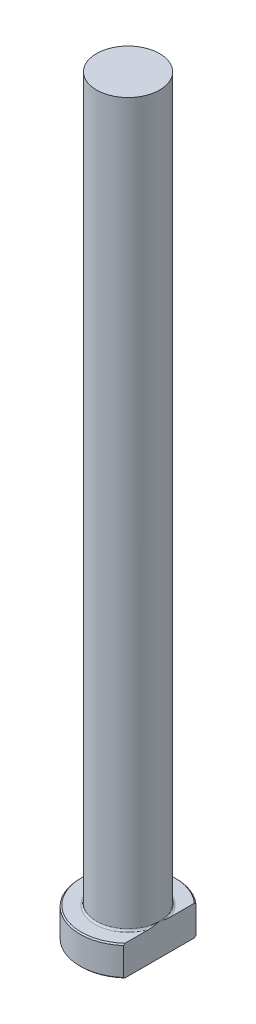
ISO-10303-21;
HEADER;
FILE_DESCRIPTION(('STEP AP214'),'2;1');
FILE_NAME('part.step','',(''),(''),'','','');
FILE_SCHEMA(('AUTOMOTIVE_DESIGN { 1 0 10303 214 1 1 1 1 }'));
ENDSEC;
DATA;
#1=APPLICATION_CONTEXT('core data for automotive mechanical design processes');
#2=APPLICATION_PROTOCOL_DEFINITION('international standard','automotive_design',2000,#1);
#3=PRODUCT_CONTEXT('',#1,'mechanical');
#4=PRODUCT('Part','Part','',(#3));
#5=PRODUCT_RELATED_PRODUCT_CATEGORY('part','',(#4));
#6=PRODUCT_DEFINITION_FORMATION('','',#4);
#7=PRODUCT_DEFINITION_CONTEXT('part definition',#1,'design');
#8=PRODUCT_DEFINITION('design','',#6,#7);
#9=PRODUCT_DEFINITION_SHAPE('','',#8);
#10=(LENGTH_UNIT() NAMED_UNIT(*) SI_UNIT(.MILLI.,.METRE.));
#11=(NAMED_UNIT(*) PLANE_ANGLE_UNIT() SI_UNIT($,.RADIAN.));
#12=(NAMED_UNIT(*) SI_UNIT($,.STERADIAN.) SOLID_ANGLE_UNIT());
#13=UNCERTAINTY_MEASURE_WITH_UNIT(LENGTH_MEASURE(1.E-05),#10,'distance_accuracy_value','');
#14=(GEOMETRIC_REPRESENTATION_CONTEXT(3) GLOBAL_UNCERTAINTY_ASSIGNED_CONTEXT((#13)) GLOBAL_UNIT_ASSIGNED_CONTEXT((#10,
#11,#12)) REPRESENTATION_CONTEXT('',''));
#15=CARTESIAN_POINT('',(0.,0.,0.));
#16=DIRECTION('',(0.,0.,1.));
#17=DIRECTION('',(1.,0.,0.));
#18=AXIS2_PLACEMENT_3D('',#15,#16,#17);
#19=CARTESIAN_POINT('',(0.,0.,0.));
#20=DIRECTION('',(0.,-1.,0.));
#21=DIRECTION('',(0.,0.,-1.));
#22=AXIS2_PLACEMENT_3D('',#19,#20,#21);
#23=PLANE('',#22);
#24=CARTESIAN_POINT('',(0.,0.,0.));
#25=DIRECTION('',(0.,-1.,0.));
#26=DIRECTION('',(0.,0.,-1.));
#27=AXIS2_PLACEMENT_3D('',#24,#25,#26);
#28=CIRCLE('',#27,7.80000000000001);
#29=CARTESIAN_POINT('',(5.24999999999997,0.,5.76866535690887));
#30=VERTEX_POINT('',#29);
#31=CARTESIAN_POINT('',(5.24999999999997,0.,-5.76866535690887));
#32=VERTEX_POINT('',#31);
#33=EDGE_CURVE('E98',#30,#32,#28,.T.);
#34=ORIENTED_EDGE('',*,*,#33,.T.);
#35=DIRECTION('',(0.,0.,1.));
#36=VECTOR('',#35,1.);
#37=CARTESIAN_POINT('',(5.24999999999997,0.,-6.0363482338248));
#38=LINE('',#37,#36);
#39=EDGE_CURVE('E83',#32,#30,#38,.T.);
#40=ORIENTED_EDGE('',*,*,#39,.T.);
#41=EDGE_LOOP('',(#34,#40));
#42=FACE_BOUND('',#41,.T.);
#43=ADVANCED_FACE('F32',(#42),#23,.T.);
#44=CARTESIAN_POINT('',(0.,259.958771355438,0.));
#45=DIRECTION('',(0.,1.,0.));
#46=DIRECTION('',(0.,0.,1.));
#47=AXIS2_PLACEMENT_3D('',#44,#45,#46);
#48=CYLINDRICAL_SURFACE('',#47,7.99999999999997);
#49=CARTESIAN_POINT('',(0.,4.79999999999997,0.));
#50=DIRECTION('',(0.,1.,0.));
#51=DIRECTION('',(0.,0.,1.));
#52=AXIS2_PLACEMENT_3D('',#49,#50,#51);
#53=CIRCLE('',#52,7.99999999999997);
#54=CARTESIAN_POINT('',(5.24999999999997,4.79999999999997,6.0363482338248));
#55=VERTEX_POINT('',#54);
#56=CARTESIAN_POINT('',(5.24999999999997,4.79999999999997,-6.0363482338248));
#57=VERTEX_POINT('',#56);
#58=EDGE_CURVE('E104',#55,#57,#53,.F.);
#59=ORIENTED_EDGE('',*,*,#58,.T.);
#60=DIRECTION('',(0.,-1.,0.));
#61=VECTOR('',#60,1.);
#62=CARTESIAN_POINT('',(5.24999999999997,125.,-6.0363482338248));
#63=LINE('',#62,#61);
#64=CARTESIAN_POINT('',(5.24999999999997,0.199999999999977,-6.0363482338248));
#65=VERTEX_POINT('',#64);
#66=EDGE_CURVE('E183',#57,#65,#63,.T.);
#67=ORIENTED_EDGE('',*,*,#66,.T.);
#68=CARTESIAN_POINT('',(0.,0.199999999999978,0.));
#69=DIRECTION('',(0.,-1.,0.));
#70=DIRECTION('',(0.,0.,-1.));
#71=AXIS2_PLACEMENT_3D('',#68,#69,#70);
#72=CIRCLE('',#71,7.99999999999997);
#73=CARTESIAN_POINT('',(5.24999999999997,0.199999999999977,6.0363482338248));
#74=VERTEX_POINT('',#73);
#75=EDGE_CURVE('E100',#65,#74,#72,.F.);
#76=ORIENTED_EDGE('',*,*,#75,.T.);
#77=DIRECTION('',(0.,-1.,0.));
#78=VECTOR('',#77,1.);
#79=CARTESIAN_POINT('',(5.24999999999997,125.,6.0363482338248));
#80=LINE('',#79,#78);
#81=EDGE_CURVE('E93',#55,#74,#80,.T.);
#82=ORIENTED_EDGE('',*,*,#81,.F.);
#83=EDGE_LOOP('',(#59,#67,#76,#82));
#84=FACE_BOUND('',#83,.T.);
#85=ADVANCED_FACE('F158',(#84),#48,.T.);
#86=CARTESIAN_POINT('',(-7.99999999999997,5.,0.));
#87=DIRECTION('',(0.,1.,0.));
#88=DIRECTION('',(0.,0.,1.));
#89=AXIS2_PLACEMENT_3D('',#86,#87,#88);
#90=PLANE('',#89);
#91=CARTESIAN_POINT('',(0.,5.,0.));
#92=DIRECTION('',(0.,1.,0.));
#93=DIRECTION('',(0.,0.,1.));
#94=AXIS2_PLACEMENT_3D('',#91,#92,#93);
#95=CIRCLE('',#94,7.79999999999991);
#96=CARTESIAN_POINT('',(5.24999999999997,5.,-5.76866535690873));
#97=VERTEX_POINT('',#96);
#98=CARTESIAN_POINT('',(5.24999999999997,5.,5.76866535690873));
#99=VERTEX_POINT('',#98);
#100=EDGE_CURVE('E178',#97,#99,#95,.T.);
#101=ORIENTED_EDGE('',*,*,#100,.T.);
#102=DIRECTION('',(0.,0.,-1.));
#103=VECTOR('',#102,1.);
#104=CARTESIAN_POINT('',(5.24999999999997,5.,0.));
#105=LINE('',#104,#103);
#106=CARTESIAN_POINT('',(5.24999999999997,4.99999999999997,1.79999999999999));
#107=VERTEX_POINT('',#106);
#108=EDGE_CURVE('E57',#99,#107,#105,.T.);
#109=ORIENTED_EDGE('',*,*,#108,.T.);
#110=CARTESIAN_POINT('',(0.,5.,0.));
#111=DIRECTION('',(0.,1.,0.));
#112=DIRECTION('',(0.,0.,1.));
#113=AXIS2_PLACEMENT_3D('',#110,#111,#112);
#114=CIRCLE('',#113,5.54999999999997);
#115=CARTESIAN_POINT('',(5.24999999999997,4.99999999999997,-1.79999999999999));
#116=VERTEX_POINT('',#115);
#117=EDGE_CURVE('E107',#107,#116,#114,.F.);
#118=ORIENTED_EDGE('',*,*,#117,.T.);
#119=EDGE_CURVE('E136',#116,#97,#105,.T.);
#120=ORIENTED_EDGE('',*,*,#119,.T.);
#121=EDGE_LOOP('',(#101,#109,#118,#120));
#122=FACE_BOUND('',#121,.T.);
#123=ADVANCED_FACE('F147',(#122),#90,.T.);
#124=CARTESIAN_POINT('',(0.,5.,0.));
#125=DIRECTION('',(0.,-1.,0.));
#126=DIRECTION('',(0.,0.,-1.));
#127=AXIS2_PLACEMENT_3D('',#124,#125,#126);
#128=CONICAL_SURFACE('',#127,7.7999999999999,0.785398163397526);
#129=ORIENTED_EDGE('',*,*,#58,.F.);
#130=CARTESIAN_POINT('',(5.24999999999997,-1.48116632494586,13.2811600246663));
#131=CARTESIAN_POINT('',(5.24999999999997,-1.29357250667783,13.0794377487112));
#132=CARTESIAN_POINT('',(5.24999999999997,-1.1062845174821,12.8774311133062));
#133=CARTESIAN_POINT('',(5.24999999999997,-0.73241592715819,12.4727618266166));
#134=CARTESIAN_POINT('',(5.24999999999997,-0.545835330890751,12.270099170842));
#135=CARTESIAN_POINT('',(5.24999999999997,0.0127787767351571,11.6609122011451));
#136=CARTESIAN_POINT('',(5.24999999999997,0.383603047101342,11.2532764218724));
#137=CARTESIAN_POINT('',(5.24999999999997,1.1232534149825,10.4315008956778));
#138=CARTESIAN_POINT('',(5.24999999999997,1.49205195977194,10.0173363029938));
#139=CARTESIAN_POINT('',(5.24999999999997,2.22349880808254,9.18368237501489));
#140=CARTESIAN_POINT('',(5.24999999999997,2.58614786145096,8.76419369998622));
#141=CARTESIAN_POINT('',(5.24999999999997,3.23008746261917,8.00331710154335));
#142=CARTESIAN_POINT('',(5.24999999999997,3.51299211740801,7.66330157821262));
#143=CARTESIAN_POINT('',(5.24999999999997,3.93141579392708,7.14837202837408));
#144=CARTESIAN_POINT('',(5.24999999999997,4.06992138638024,6.97588542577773));
#145=CARTESIAN_POINT('',(5.24999999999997,4.3445270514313,6.62901010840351));
#146=CARTESIAN_POINT('',(5.24999999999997,4.48062717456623,6.45462143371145));
#147=CARTESIAN_POINT('',(5.24999999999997,4.74973822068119,6.10383934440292));
#148=CARTESIAN_POINT('',(5.24999999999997,4.88275300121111,5.92744889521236));
#149=CARTESIAN_POINT('',(5.24999999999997,5.14521399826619,5.57203856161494));
#150=CARTESIAN_POINT('',(5.24999999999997,5.27466038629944,5.39301880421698));
#151=CARTESIAN_POINT('',(5.24999999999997,5.52907482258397,5.03192492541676));
#152=CARTESIAN_POINT('',(5.24999999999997,5.65404469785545,4.84985209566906));
#153=CARTESIAN_POINT('',(5.24999999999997,5.89840426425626,4.48201214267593));
#154=CARTESIAN_POINT('',(5.24999999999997,6.01779462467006,4.2962454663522));
#155=CARTESIAN_POINT('',(5.24999999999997,6.24171029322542,3.93290441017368));
#156=CARTESIAN_POINT('',(5.24999999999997,6.346695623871,3.75561494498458));
#157=CARTESIAN_POINT('',(5.24999999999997,6.54883017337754,3.39656407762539));
#158=CARTESIAN_POINT('',(5.24999999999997,6.64597853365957,3.21480218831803));
#159=CARTESIAN_POINT('',(5.24999999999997,6.83020392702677,2.84629933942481));
#160=CARTESIAN_POINT('',(5.24999999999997,6.91728535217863,2.6595605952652));
#161=CARTESIAN_POINT('',(5.24999999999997,7.07861709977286,2.28058919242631));
#162=CARTESIAN_POINT('',(5.24999999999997,7.15287080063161,2.08835799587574));
#163=CARTESIAN_POINT('',(5.24999999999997,7.27107095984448,1.73993363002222));
#164=CARTESIAN_POINT('',(5.24999999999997,7.31810380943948,1.58479376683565));
#165=CARTESIAN_POINT('',(5.24999999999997,7.40035184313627,1.27142880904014));
#166=CARTESIAN_POINT('',(5.24999999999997,7.43557139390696,1.11320487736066));
#167=CARTESIAN_POINT('',(5.24999999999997,7.49247262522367,0.794842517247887));
#168=CARTESIAN_POINT('',(5.24999999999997,7.51419839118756,0.63471208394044));
#169=CARTESIAN_POINT('',(5.24999999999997,7.54310705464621,0.313132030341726));
#170=CARTESIAN_POINT('',(5.24999999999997,7.55029089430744,0.151682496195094));
#171=CARTESIAN_POINT('',(5.24999999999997,7.54968998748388,-0.171726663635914));
#172=CARTESIAN_POINT('',(5.24999999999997,7.54185529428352,-0.333686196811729));
#173=CARTESIAN_POINT('',(5.24999999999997,7.51158499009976,-0.656223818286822));
#174=CARTESIAN_POINT('',(5.24999999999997,7.48914825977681,-0.816801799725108));
#175=CARTESIAN_POINT('',(5.24999999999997,7.43080718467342,-1.1359788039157));
#176=CARTESIAN_POINT('',(5.24999999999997,7.39486058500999,-1.29456998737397));
#177=CARTESIAN_POINT('',(5.24999999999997,7.3111836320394,-1.608578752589));
#178=CARTESIAN_POINT('',(5.24999999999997,7.26345259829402,-1.76399615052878));
#179=CARTESIAN_POINT('',(5.24999999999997,7.1531515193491,-2.0854871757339));
#180=CARTESIAN_POINT('',(5.24999999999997,7.08962117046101,-2.25122835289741));
#181=CARTESIAN_POINT('',(5.24999999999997,6.95279918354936,-2.57864196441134));
#182=CARTESIAN_POINT('',(5.24999999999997,6.87950469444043,-2.74031319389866));
#183=CARTESIAN_POINT('',(5.24999999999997,6.72489088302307,-3.06007692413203));
#184=CARTESIAN_POINT('',(5.24999999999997,6.64355831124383,-3.2181629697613));
#185=CARTESIAN_POINT('',(5.24999999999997,6.47449809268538,-3.53083072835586));
#186=CARTESIAN_POINT('',(5.24999999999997,6.38677122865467,-3.68541286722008));
#187=CARTESIAN_POINT('',(5.24999999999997,6.20495786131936,-3.99346169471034));
#188=CARTESIAN_POINT('',(5.24999999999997,6.11080410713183,-4.1468885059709));
#189=CARTESIAN_POINT('',(5.24999999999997,5.91814750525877,-4.45098066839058));
#190=CARTESIAN_POINT('',(5.24999999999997,5.81964456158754,-4.60164595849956));
#191=CARTESIAN_POINT('',(5.24999999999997,5.61916095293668,-4.9004290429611));
#192=CARTESIAN_POINT('',(5.24999999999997,5.51718369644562,-5.04854913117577));
#193=CARTESIAN_POINT('',(5.24999999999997,5.31027155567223,-5.34270095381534));
#194=CARTESIAN_POINT('',(5.24999999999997,5.2053367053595,-5.48873271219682));
#195=CARTESIAN_POINT('',(5.24999999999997,4.97106981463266,-5.80895105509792));
#196=CARTESIAN_POINT('',(5.24999999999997,4.84117419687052,-5.98272485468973));
#197=CARTESIAN_POINT('',(5.24999999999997,4.57844088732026,-6.32803694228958));
#198=CARTESIAN_POINT('',(5.24999999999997,4.44560309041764,-6.49957515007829));
#199=CARTESIAN_POINT('',(5.24999999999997,4.04344241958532,-7.01138747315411));
#200=CARTESIAN_POINT('',(5.24999999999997,3.77050218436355,-7.34881891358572));
#201=CARTESIAN_POINT('',(5.24999999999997,3.21761339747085,-8.01842681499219));
#202=CARTESIAN_POINT('',(5.24999999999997,2.93765803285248,-8.35059761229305));
#203=CARTESIAN_POINT('',(5.24999999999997,2.37280482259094,-9.01071908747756));
#204=CARTESIAN_POINT('',(5.24999999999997,2.08790682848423,-9.33866963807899));
#205=CARTESIAN_POINT('',(5.24999999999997,1.53221513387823,-9.97104652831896));
#206=CARTESIAN_POINT('',(5.24999999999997,1.26164416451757,-10.2756690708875));
#207=CARTESIAN_POINT('',(5.24999999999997,0.717945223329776,-10.8826342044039));
#208=CARTESIAN_POINT('',(5.24999999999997,0.444817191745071,-11.1849767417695));
#209=CARTESIAN_POINT('',(5.24999999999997,-0.102863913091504,-11.7871569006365));
#210=CARTESIAN_POINT('',(5.24999999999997,-0.3774125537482,-12.0869985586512));
#211=CARTESIAN_POINT('',(5.24999999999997,-0.92814850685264,-12.6851474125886));
#212=CARTESIAN_POINT('',(5.24999999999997,-1.20433574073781,-12.9834546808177));
#213=CARTESIAN_POINT('',(5.24999999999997,-1.48116632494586,-13.2811600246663));
#214=B_SPLINE_CURVE_WITH_KNOTS('',3,(#130,#131,#132,#133,#134,#135,#136,#137,#138,#139,#140,
#141,#142,#143,#144,#145,#146,#147,#148,#149,#150,#151,#152,#153,#154,#155,#156,#157,#158,#159,
#160,#161,#162,#163,#164,#165,#166,#167,#168,#169,#170,#171,#172,#173,#174,#175,#176,#177,#178,
#179,#180,#181,#182,#183,#184,#185,#186,#187,#188,#189,#190,#191,#192,#193,#194,#195,#196,#197,
#198,#199,#200,#201,#202,#203,#204,#205,#206,#207,#208,#209,#210,#211,#212,#213),.UNSPECIFIED.,
.F.,.F.,(4,2,2,2,2,2,2,2,2,2,2,2,2,2,2,2,2,2,2,2,2,2,2,2,2,2,2,2,2,2,2,2,2,2,2,2,2,2,2,2,2,4),
(0.,0.826407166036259,1.65282000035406,3.30600459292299,4.96966514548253,6.63312135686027,
7.95997894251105,8.62360280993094,9.28721271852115,9.9499425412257,10.6126404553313,
11.2750647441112,11.9374093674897,12.5553811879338,13.1734206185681,13.791189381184,
14.4087951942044,14.8947423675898,15.3805097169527,15.8646815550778,16.3488220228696,
16.8345753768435,17.3203659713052,17.8076887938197,18.295039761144,18.8271554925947,
19.359426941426,19.8925908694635,20.4256896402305,20.9656407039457,21.5056036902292,
22.0450513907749,22.5844928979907,23.2353229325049,23.8861762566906,25.1880335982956,
26.4912084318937,27.794422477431,29.0167115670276,30.2390292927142,31.4586693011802,
32.678251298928),.UNSPECIFIED.);
#215=EDGE_CURVE('E135',#55,#99,#214,.T.);
#216=ORIENTED_EDGE('',*,*,#215,.T.);
#217=ORIENTED_EDGE('',*,*,#100,.F.);
#218=EDGE_CURVE('E127',#97,#57,#214,.T.);
#219=ORIENTED_EDGE('',*,*,#218,.T.);
#220=EDGE_LOOP('',(#129,#216,#217,#219));
#221=FACE_BOUND('',#220,.T.);
#222=ADVANCED_FACE('F143',(#221),#128,.T.);
#223=CARTESIAN_POINT('',(0.,0.199999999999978,0.));
#224=DIRECTION('',(0.,1.,0.));
#225=DIRECTION('',(0.,0.,1.));
#226=AXIS2_PLACEMENT_3D('',#223,#224,#225);
#227=CONICAL_SURFACE('',#226,7.99999999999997,0.785398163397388);
#228=ORIENTED_EDGE('',*,*,#75,.F.);
#229=CARTESIAN_POINT('',(5.24999999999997,6.48116632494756,-13.2811600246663));
#230=CARTESIAN_POINT('',(5.24999999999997,6.2935725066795,-13.0794377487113));
#231=CARTESIAN_POINT('',(5.24999999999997,6.10628451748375,-12.8774311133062));
#232=CARTESIAN_POINT('',(5.24999999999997,5.73241592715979,-12.4727618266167));
#233=CARTESIAN_POINT('',(5.24999999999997,5.54583533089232,-12.2700991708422));
#234=CARTESIAN_POINT('',(5.24999999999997,4.98722122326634,-11.6609122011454));
#235=CARTESIAN_POINT('',(5.24999999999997,4.61639695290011,-11.2532764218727));
#236=CARTESIAN_POINT('',(5.24999999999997,3.87674658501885,-10.4315008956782));
#237=CARTESIAN_POINT('',(5.24999999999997,3.50794804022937,-10.0173363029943));
#238=CARTESIAN_POINT('',(5.24999999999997,2.77650119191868,-9.18368237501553));
#239=CARTESIAN_POINT('',(5.24999999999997,2.41385213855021,-8.76419369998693));
#240=CARTESIAN_POINT('',(5.24999999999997,1.76991253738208,-8.00331710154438));
#241=CARTESIAN_POINT('',(5.24999999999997,1.48700788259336,-7.66330157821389));
#242=CARTESIAN_POINT('',(5.24999999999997,1.06858420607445,-7.14837202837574));
#243=CARTESIAN_POINT('',(5.24999999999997,0.930078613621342,-6.97588542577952));
#244=CARTESIAN_POINT('',(5.24999999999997,0.655472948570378,-6.62901010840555));
#245=CARTESIAN_POINT('',(5.24999999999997,0.519372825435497,-6.45462143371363));
#246=CARTESIAN_POINT('',(5.24999999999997,0.250261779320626,-6.10383934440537));
#247=CARTESIAN_POINT('',(5.24999999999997,0.11724699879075,-5.92744889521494));
#248=CARTESIAN_POINT('',(5.24999999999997,-0.145213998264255,-5.57203856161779));
#249=CARTESIAN_POINT('',(5.24999999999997,-0.274660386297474,-5.39301880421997));
#250=CARTESIAN_POINT('',(5.24999999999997,-0.529074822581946,-5.03192492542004));
#251=CARTESIAN_POINT('',(5.24999999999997,-0.654044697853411,-4.84985209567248));
#252=CARTESIAN_POINT('',(5.24999999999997,-0.898404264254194,-4.48201214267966));
#253=CARTESIAN_POINT('',(5.24999999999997,-1.01779462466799,-4.29624546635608));
#254=CARTESIAN_POINT('',(5.24999999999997,-1.24171029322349,-3.93290441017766));
#255=CARTESIAN_POINT('',(5.24999999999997,-1.3466956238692,-3.7556149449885));
#256=CARTESIAN_POINT('',(5.24999999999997,-1.54883017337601,-3.39656407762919));
#257=CARTESIAN_POINT('',(5.24999999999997,-1.64597853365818,-3.21480218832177));
#258=CARTESIAN_POINT('',(5.24999999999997,-1.83020392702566,-2.84629933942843));
#259=CARTESIAN_POINT('',(5.24999999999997,-1.91728535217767,-2.65956059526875));
#260=CARTESIAN_POINT('',(5.24999999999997,-2.07861709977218,-2.28058919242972));
#261=CARTESIAN_POINT('',(5.24999999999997,-2.15287080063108,-2.08835799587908));
#262=CARTESIAN_POINT('',(5.24999999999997,-2.27107095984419,-1.7399336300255));
#263=CARTESIAN_POINT('',(5.24999999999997,-2.31810380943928,-1.58479376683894));
#264=CARTESIAN_POINT('',(5.24999999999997,-2.40035184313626,-1.27142880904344));
#265=CARTESIAN_POINT('',(5.24999999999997,-2.43557139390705,-1.11320487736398));
#266=CARTESIAN_POINT('',(5.24999999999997,-2.49247262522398,-0.794842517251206));
#267=CARTESIAN_POINT('',(5.24999999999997,-2.51419839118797,-0.634712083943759));
#268=CARTESIAN_POINT('',(5.24999999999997,-2.54310705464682,-0.313132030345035));
#269=CARTESIAN_POINT('',(5.24999999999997,-2.55029089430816,-0.151682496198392));
#270=CARTESIAN_POINT('',(5.24999999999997,-2.5496899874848,0.171726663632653));
#271=CARTESIAN_POINT('',(5.24999999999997,-2.54185529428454,0.333686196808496));
#272=CARTESIAN_POINT('',(5.24999999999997,-2.51158499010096,0.65622381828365));
#273=CARTESIAN_POINT('',(5.24999999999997,-2.48914825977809,0.816801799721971));
#274=CARTESIAN_POINT('',(5.24999999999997,-2.43080718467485,1.13597880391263));
#275=CARTESIAN_POINT('',(5.24999999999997,-2.39486058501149,1.29456998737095));
#276=CARTESIAN_POINT('',(5.24999999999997,-2.31118363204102,1.60857875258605));
#277=CARTESIAN_POINT('',(5.24999999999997,-2.26345259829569,1.76399615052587));
#278=CARTESIAN_POINT('',(5.24999999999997,-2.15315151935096,2.08548717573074));
#279=CARTESIAN_POINT('',(5.24999999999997,-2.08962117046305,2.25122835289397));
#280=CARTESIAN_POINT('',(5.24999999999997,-1.95279918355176,2.57864196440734));
#281=CARTESIAN_POINT('',(5.24999999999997,-1.87950469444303,2.74031319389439));
#282=CARTESIAN_POINT('',(5.24999999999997,-1.72489088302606,3.06007692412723));
#283=CARTESIAN_POINT('',(5.24999999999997,-1.64355831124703,3.21816296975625));
#284=CARTESIAN_POINT('',(5.24999999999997,-1.47449809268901,3.53083072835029));
#285=CARTESIAN_POINT('',(5.24999999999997,-1.38677122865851,3.68541286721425));
#286=CARTESIAN_POINT('',(5.24999999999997,-1.20495786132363,3.99346169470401));
#287=CARTESIAN_POINT('',(5.24999999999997,-1.11080410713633,4.14688850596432));
#288=CARTESIAN_POINT('',(5.24999999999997,-0.91814750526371,4.4509806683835));
#289=CARTESIAN_POINT('',(5.24999999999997,-0.819644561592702,4.60164595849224));
#290=CARTESIAN_POINT('',(5.24999999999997,-0.619160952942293,4.90042904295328));
#291=CARTESIAN_POINT('',(5.24999999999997,-0.517183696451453,5.04854913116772));
#292=CARTESIAN_POINT('',(5.24999999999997,-0.310271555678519,5.34270095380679));
#293=CARTESIAN_POINT('',(5.24999999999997,-0.205336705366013,5.48873271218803));
#294=CARTESIAN_POINT('',(5.24999999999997,0.0289301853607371,5.80895105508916));
#295=CARTESIAN_POINT('',(5.24999999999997,0.158825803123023,5.98272485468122));
#296=CARTESIAN_POINT('',(5.24999999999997,0.421559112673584,6.32803694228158));
#297=CARTESIAN_POINT('',(5.24999999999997,0.55439690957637,6.49957515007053));
#298=CARTESIAN_POINT('',(5.24999999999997,0.95655758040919,7.01138747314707));
#299=CARTESIAN_POINT('',(5.24999999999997,1.22949781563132,7.34881891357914));
#300=CARTESIAN_POINT('',(5.24999999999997,1.78238660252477,8.0184268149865));
#301=CARTESIAN_POINT('',(5.24999999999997,2.06234196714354,8.3505976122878));
#302=CARTESIAN_POINT('',(5.24999999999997,2.62719517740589,9.01071908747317));
#303=CARTESIAN_POINT('',(5.24999999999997,2.91209317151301,9.33866963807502));
#304=CARTESIAN_POINT('',(5.24999999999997,3.46778486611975,9.97104652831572));
#305=CARTESIAN_POINT('',(5.24999999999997,3.73835583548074,10.2756690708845));
#306=CARTESIAN_POINT('',(5.24999999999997,4.28205477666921,10.8826342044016));
#307=CARTESIAN_POINT('',(5.24999999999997,4.55518280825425,11.1849767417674));
#308=CARTESIAN_POINT('',(5.24999999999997,5.1028639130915,11.787156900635));
#309=CARTESIAN_POINT('',(5.24999999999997,5.37741255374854,12.0869985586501));
#310=CARTESIAN_POINT('',(5.24999999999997,5.92814850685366,12.685147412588));
#311=CARTESIAN_POINT('',(5.24999999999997,6.20433574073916,12.9834546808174));
#312=CARTESIAN_POINT('',(5.24999999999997,6.48116632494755,13.2811600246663));
#313=B_SPLINE_CURVE_WITH_KNOTS('',3,(#229,#230,#231,#232,#233,#234,#235,#236,#237,#238,#239,
#240,#241,#242,#243,#244,#245,#246,#247,#248,#249,#250,#251,#252,#253,#254,#255,#256,#257,#258,
#259,#260,#261,#262,#263,#264,#265,#266,#267,#268,#269,#270,#271,#272,#273,#274,#275,#276,#277,
#278,#279,#280,#281,#282,#283,#284,#285,#286,#287,#288,#289,#290,#291,#292,#293,#294,#295,#296,
#297,#298,#299,#300,#301,#302,#303,#304,#305,#306,#307,#308,#309,#310,#311,#312),.UNSPECIFIED.,
.F.,.F.,(4,2,2,2,2,2,2,2,2,2,2,2,2,2,2,2,2,2,2,2,2,2,2,2,2,2,2,2,2,2,2,2,2,2,2,2,2,2,2,2,2,4),
(0.,0.826407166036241,1.65282000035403,3.30600459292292,4.9696651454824,6.63312135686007,
7.95997894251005,8.62360280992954,9.28721271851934,9.9499425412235,10.6126404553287,
11.2750647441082,11.9374093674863,12.5553811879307,13.1734206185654,13.7911893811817,
14.4087951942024,14.8947423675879,15.3805097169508,15.864681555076,16.3488220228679,
16.8345753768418,17.3203659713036,17.8076887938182,18.2950397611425,18.8271554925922,
19.3594269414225,19.8925908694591,20.4256896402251,20.9656407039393,21.5056036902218,
22.0450513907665,22.5844928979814,23.2353229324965,23.886176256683,25.1880335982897,
26.4912084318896,27.7944224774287,29.0167115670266,30.2390292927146,31.4586693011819,
32.6782512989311),.UNSPECIFIED.);
#314=EDGE_CURVE('E86',#65,#32,#313,.T.);
#315=ORIENTED_EDGE('',*,*,#314,.T.);
#316=ORIENTED_EDGE('',*,*,#33,.F.);
#317=EDGE_CURVE('E89',#30,#74,#313,.T.);
#318=ORIENTED_EDGE('',*,*,#317,.T.);
#319=EDGE_LOOP('',(#228,#315,#316,#318));
#320=FACE_BOUND('',#319,.T.);
#321=ADVANCED_FACE('F97',(#320),#227,.T.);
#322=CARTESIAN_POINT('',(0.,5.29999999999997,0.));
#323=DIRECTION('',(0.,1.,0.));
#324=DIRECTION('',(0.,0.,1.));
#325=AXIS2_PLACEMENT_3D('',#322,#323,#324);
#326=TOROIDAL_SURFACE('',#325,5.54999999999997,0.3);
#327=CARTESIAN_POINT('',(5.24999999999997,5.29999999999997,0.));
#328=CARTESIAN_POINT('',(5.24999999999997,5.30000062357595,1.16656166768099E-10));
#329=CARTESIAN_POINT('',(5.24999999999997,5.30000124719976,-2.61240012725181E-07));
#330=CARTESIAN_POINT('',(5.24999999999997,5.30000240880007,-9.73737247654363E-07));
#331=CARTESIAN_POINT('',(5.24999999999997,5.3000029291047,-1.44300381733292E-06));
#332=CARTESIAN_POINT('',(5.24999999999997,5.30000402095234,-2.56984529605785E-06));
#333=CARTESIAN_POINT('',(5.24999999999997,5.30000457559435,-3.24572224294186E-06));
#334=CARTESIAN_POINT('',(5.24999999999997,5.30000555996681,-4.63899443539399E-06));
#335=CARTESIAN_POINT('',(5.24999999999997,5.30000599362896,-5.35385174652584E-06));
#336=CARTESIAN_POINT('',(5.24999999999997,5.30000762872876,-8.15275638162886E-06));
#337=CARTESIAN_POINT('',(5.24999999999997,5.30000874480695,-1.02903375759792E-05));
#338=CARTESIAN_POINT('',(5.24999999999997,5.30001055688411,-1.44997307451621E-05));
#339=CARTESIAN_POINT('',(5.24999999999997,5.30001128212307,-1.65594410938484E-05));
#340=CARTESIAN_POINT('',(5.24999999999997,5.30001436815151,-2.53621688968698E-05));
#341=CARTESIAN_POINT('',(5.24999999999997,5.30001670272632,-3.21176555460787E-05));
#342=CARTESIAN_POINT('',(5.24999999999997,5.30002009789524,-4.48185660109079E-05));
#343=CARTESIAN_POINT('',(5.24999999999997,5.30002130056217,-5.07256098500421E-05));
#344=CARTESIAN_POINT('',(5.24999999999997,5.300030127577,-9.48741140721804E-05));
#345=CARTESIAN_POINT('',(5.24999999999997,5.30003689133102,-0.000133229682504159));
#346=CARTESIAN_POINT('',(5.24999999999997,5.30006649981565,-0.00028531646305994));
#347=CARTESIAN_POINT('',(5.24999999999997,5.30009467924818,-0.000398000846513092));
#348=CARTESIAN_POINT('',(5.24999999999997,5.30020485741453,-0.000845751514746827));
#349=CARTESIAN_POINT('',(5.24999999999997,5.30028346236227,-0.00118137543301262));
#350=CARTESIAN_POINT('',(5.24999999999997,5.30059922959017,-0.00251998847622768));
#351=CARTESIAN_POINT('',(5.24999999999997,5.30084070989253,-0.0035222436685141));
#352=CARTESIAN_POINT('',(5.24999999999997,5.3018480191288,-0.00771382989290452));
#353=CARTESIAN_POINT('',(5.24999999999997,5.30260840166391,-0.0109040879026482));
#354=CARTESIAN_POINT('',(5.24999999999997,5.30980219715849,-0.0410723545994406));
#355=CARTESIAN_POINT('',(5.24999999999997,5.31625953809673,-0.0680464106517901));
#356=CARTESIAN_POINT('',(5.24999999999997,5.32887570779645,-0.120910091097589));
#357=CARTESIAN_POINT('',(5.24999999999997,5.33503603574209,-0.146799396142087));
#358=CARTESIAN_POINT('',(5.24999999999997,5.34810832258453,-0.201908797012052));
#359=CARTESIAN_POINT('',(5.24999999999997,5.35501531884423,-0.231130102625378));
#360=CARTESIAN_POINT('',(5.24999999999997,5.3688279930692,-0.289915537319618));
#361=CARTESIAN_POINT('',(5.24999999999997,5.37573280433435,-0.31947986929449));
#362=CARTESIAN_POINT('',(5.24999999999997,5.39233240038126,-0.391129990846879));
#363=CARTESIAN_POINT('',(5.24999999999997,5.40197331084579,-0.433228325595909));
#364=CARTESIAN_POINT('',(5.24999999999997,5.42071775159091,-0.516417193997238));
#365=CARTESIAN_POINT('',(5.24999999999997,5.42982871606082,-0.557506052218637));
#366=CARTESIAN_POINT('',(5.24999999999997,5.45024545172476,-0.651521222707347));
#367=CARTESIAN_POINT('',(5.24999999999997,5.46143398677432,-0.70447326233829));
#368=CARTESIAN_POINT('',(5.24999999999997,5.48311687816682,-0.810941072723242));
#369=CARTESIAN_POINT('',(5.24999999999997,5.49360525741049,-0.864458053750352));
#370=CARTESIAN_POINT('',(5.24999999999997,5.5252275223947,-1.03405951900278));
#371=CARTESIAN_POINT('',(5.24999999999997,5.54454970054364,-1.15049679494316));
#372=CARTESIAN_POINT('',(5.24999999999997,5.57371765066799,-1.36731361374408));
#373=CARTESIAN_POINT('',(5.24999999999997,5.58453543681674,-1.4675540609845));
#374=CARTESIAN_POINT('',(5.24999999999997,5.59494335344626,-1.61734655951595));
#375=CARTESIAN_POINT('',(5.24999999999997,5.5974458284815,-1.66669122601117));
#376=CARTESIAN_POINT('',(5.24999999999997,5.60018139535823,-1.76542367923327));
#377=CARTESIAN_POINT('',(5.24999999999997,5.60041538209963,-1.81481144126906));
#378=CARTESIAN_POINT('',(5.24999999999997,5.59770699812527,-1.92992281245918));
#379=CARTESIAN_POINT('',(5.24999999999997,5.59368653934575,-1.99563731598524));
#380=CARTESIAN_POINT('',(5.24999999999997,5.58239535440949,-2.09375112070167));
#381=CARTESIAN_POINT('',(5.24999999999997,5.5777387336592,-2.12645109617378));
#382=CARTESIAN_POINT('',(5.24999999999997,5.56623568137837,-2.19145637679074));
#383=CARTESIAN_POINT('',(5.24999999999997,5.55939081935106,-2.22376194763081));
#384=CARTESIAN_POINT('',(5.24999999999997,5.54289171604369,-2.28774017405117));
#385=CARTESIAN_POINT('',(5.24999999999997,5.53323089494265,-2.31941115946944));
#386=CARTESIAN_POINT('',(5.24999999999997,5.5101870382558,-2.38130147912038));
#387=CARTESIAN_POINT('',(5.24999999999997,5.49682279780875,-2.41152726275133));
#388=CARTESIAN_POINT('',(5.24999999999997,5.47383686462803,-2.45267588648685));
#389=CARTESIAN_POINT('',(5.24999999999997,5.46640062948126,-2.46481176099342));
#390=CARTESIAN_POINT('',(5.24999999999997,5.45028535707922,-2.48829012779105));
#391=CARTESIAN_POINT('',(5.24999999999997,5.44160336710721,-2.49963063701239));
#392=CARTESIAN_POINT('',(5.24999999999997,5.42264067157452,-2.52121093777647));
#393=CARTESIAN_POINT('',(5.24999999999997,5.41233846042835,-2.53143222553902));
#394=CARTESIAN_POINT('',(5.24999999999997,5.39001295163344,-2.54977752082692));
#395=CARTESIAN_POINT('',(5.24999999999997,5.3779990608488,-2.55791235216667));
#396=CARTESIAN_POINT('',(5.24999999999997,5.35800000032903,-2.56805143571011));
#397=CARTESIAN_POINT('',(5.24999999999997,5.3505843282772,-2.57117564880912));
#398=CARTESIAN_POINT('',(5.24999999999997,5.33534289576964,-2.57618429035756));
#399=CARTESIAN_POINT('',(5.24999999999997,5.32751754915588,-2.57806994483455));
#400=CARTESIAN_POINT('',(5.24999999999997,5.311605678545,-2.58043009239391));
#401=CARTESIAN_POINT('',(5.24999999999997,5.3035179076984,-2.58089637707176));
#402=CARTESIAN_POINT('',(5.24999999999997,5.28739280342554,-2.58034271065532));
#403=CARTESIAN_POINT('',(5.24999999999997,5.27935547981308,-2.5793224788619));
#404=CARTESIAN_POINT('',(5.24999999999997,5.2641286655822,-2.576023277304));
#405=CARTESIAN_POINT('',(5.24999999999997,5.25691883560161,-2.57383545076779));
#406=CARTESIAN_POINT('',(5.24999999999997,5.24289768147,-2.56843751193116));
#407=CARTESIAN_POINT('',(5.24999999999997,5.23608651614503,-2.5652269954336));
#408=CARTESIAN_POINT('',(5.24999999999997,5.21908960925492,-2.55585712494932));
#409=CARTESIAN_POINT('',(5.24999999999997,5.20925106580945,-2.54906973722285));
#410=CARTESIAN_POINT('',(5.24999999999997,5.19074002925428,-2.53405361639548));
#411=CARTESIAN_POINT('',(5.24999999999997,5.1820713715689,-2.52582033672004));
#412=CARTESIAN_POINT('',(5.24999999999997,5.15973027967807,-2.50189565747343));
#413=CARTESIAN_POINT('',(5.24999999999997,5.14713154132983,-2.4852116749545));
#414=CARTESIAN_POINT('',(5.24999999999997,5.12441873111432,-2.45028247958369));
#415=CARTESIAN_POINT('',(5.24999999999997,5.11430835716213,-2.43203499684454));
#416=CARTESIAN_POINT('',(5.24999999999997,5.095460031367,-2.39348631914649));
#417=CARTESIAN_POINT('',(5.24999999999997,5.08684143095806,-2.3731276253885));
#418=CARTESIAN_POINT('',(5.24999999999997,5.07130293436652,-2.33176174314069));
#419=CARTESIAN_POINT('',(5.24999999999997,5.0643850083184,-2.31075383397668));
#420=CARTESIAN_POINT('',(5.24999999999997,5.05188132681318,-2.26814065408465));
#421=CARTESIAN_POINT('',(5.24999999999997,5.04630843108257,-2.24653166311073));
#422=CARTESIAN_POINT('',(5.24999999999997,5.036346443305,-2.20306277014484));
#423=CARTESIAN_POINT('',(5.24999999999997,5.03195656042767,-2.18120304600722));
#424=CARTESIAN_POINT('',(5.24999999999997,5.02182394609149,-2.12403914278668));
#425=CARTESIAN_POINT('',(5.24999999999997,5.01686753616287,-2.08859566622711));
#426=CARTESIAN_POINT('',(5.24999999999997,5.00900730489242,-2.01747645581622));
#427=CARTESIAN_POINT('',(5.24999999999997,5.0061045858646,-1.98180060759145));
#428=CARTESIAN_POINT('',(5.24999999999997,4.99990490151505,-1.87441007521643));
#429=CARTESIAN_POINT('',(5.24999999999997,4.99914942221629,-1.80254846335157));
#430=CARTESIAN_POINT('',(5.24999999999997,5.00239161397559,-1.66261916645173));
#431=CARTESIAN_POINT('',(5.24999999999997,5.00615102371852,-1.59454326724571));
#432=CARTESIAN_POINT('',(5.24999999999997,5.0170133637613,-1.45862908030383));
#433=CARTESIAN_POINT('',(5.24999999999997,5.02411815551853,-1.39079094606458));
#434=CARTESIAN_POINT('',(5.24999999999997,5.04416126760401,-1.22927166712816));
#435=CARTESIAN_POINT('',(5.24999999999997,5.05829298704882,-1.1357414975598));
#436=CARTESIAN_POINT('',(5.24999999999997,5.08230499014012,-0.994796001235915));
#437=CARTESIAN_POINT('',(5.24999999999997,5.09089456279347,-0.947150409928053));
#438=CARTESIAN_POINT('',(5.24999999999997,5.10886306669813,-0.851871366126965));
#439=CARTESIAN_POINT('',(5.24999999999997,5.11824411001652,-0.804238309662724));
#440=CARTESIAN_POINT('',(5.24999999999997,5.141356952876,-0.690797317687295));
#441=CARTESIAN_POINT('',(5.24999999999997,5.15537399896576,-0.625047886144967));
#442=CARTESIAN_POINT('',(5.24999999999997,5.18409655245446,-0.494483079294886));
#443=CARTESIAN_POINT('',(5.24999999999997,5.19879244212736,-0.429665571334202));
#444=CARTESIAN_POINT('',(5.24999999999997,5.22697974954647,-0.307614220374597));
#445=CARTESIAN_POINT('',(5.24999999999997,5.24041481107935,-0.250367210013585));
#446=CARTESIAN_POINT('',(5.24999999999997,5.26812039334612,-0.133445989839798));
#447=CARTESIAN_POINT('',(5.24999999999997,5.28240186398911,-0.0737742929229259));
#448=CARTESIAN_POINT('',(5.24999999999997,5.29739294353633,-0.0108979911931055));
#449=CARTESIAN_POINT('',(5.24999999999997,5.2981548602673,-0.00770166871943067));
#450=CARTESIAN_POINT('',(5.24999999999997,5.29916252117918,-0.00350872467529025));
#451=CARTESIAN_POINT('',(5.24999999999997,5.29940286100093,-0.0025111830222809));
#452=CARTESIAN_POINT('',(5.24999999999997,5.299717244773,-0.00117843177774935));
#453=CARTESIAN_POINT('',(5.24999999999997,5.2997955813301,-0.000843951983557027));
#454=CARTESIAN_POINT('',(5.24999999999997,5.29990543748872,-0.000397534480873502));
#455=CARTESIAN_POINT('',(5.24999999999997,5.29993357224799,-0.000285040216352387));
#456=CARTESIAN_POINT('',(5.24999999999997,5.29996313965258,-0.000133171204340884));
#457=CARTESIAN_POINT('',(5.24999999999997,5.29996989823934,-9.48416473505E-05));
#458=CARTESIAN_POINT('',(5.24999999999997,5.29997871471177,-5.07197787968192E-05));
#459=CARTESIAN_POINT('',(5.24999999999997,5.29997991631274,-4.48141195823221E-05));
#460=CARTESIAN_POINT('',(5.24999999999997,5.29998330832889,-3.21161025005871E-05));
#461=CARTESIAN_POINT('',(5.24999999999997,5.29998564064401,-2.53620513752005E-05));
#462=CARTESIAN_POINT('',(5.24999999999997,5.29998872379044,-1.65608283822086E-05));
#463=CARTESIAN_POINT('',(5.24999999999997,5.29998944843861,-1.4501220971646E-05));
#464=CARTESIAN_POINT('',(5.24999999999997,5.29999125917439,-1.02919418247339E-05));
#465=CARTESIAN_POINT('',(5.24999999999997,5.29999237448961,-8.15435788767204E-06));
#466=CARTESIAN_POINT('',(5.24999999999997,5.29999400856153,-5.35534366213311E-06));
#467=CARTESIAN_POINT('',(5.24999999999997,5.29999444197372,-4.6404252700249E-06));
#468=CARTESIAN_POINT('',(5.24999999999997,5.2999954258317,-3.24698579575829E-06));
#469=CARTESIAN_POINT('',(5.24999999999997,5.29999598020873,-2.57100068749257E-06));
#470=CARTESIAN_POINT('',(5.24999999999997,5.29999707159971,-1.44390781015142E-06));
#471=CARTESIAN_POINT('',(5.24999999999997,5.29999759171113,-9.74508164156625E-07));
#472=CARTESIAN_POINT('',(5.24999999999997,5.29999875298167,-2.61670627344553E-07));
#473=CARTESIAN_POINT('',(5.24999999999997,5.29999937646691,-1.166481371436E-10));
#474=CARTESIAN_POINT('',(5.24999999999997,5.29999999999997,0.));
#475=B_SPLINE_CURVE_WITH_KNOTS('',3,(#327,#328,#329,#330,#331,#332,#333,#334,#335,#336,#337,
#338,#339,#340,#341,#342,#343,#344,#345,#346,#347,#348,#349,#350,#351,#352,#353,#354,#355,#356,
#357,#358,#359,#360,#361,#362,#363,#364,#365,#366,#367,#368,#369,#370,#371,#372,#373,#374,#375,
#376,#377,#378,#379,#380,#381,#382,#383,#384,#385,#386,#387,#388,#389,#390,#391,#392,#393,#394,
#395,#396,#397,#398,#399,#400,#401,#402,#403,#404,#405,#406,#407,#408,#409,#410,#411,#412,#413,
#414,#415,#416,#417,#418,#419,#420,#421,#422,#423,#424,#425,#426,#427,#428,#429,#430,#431,#432,
#433,#434,#435,#436,#437,#438,#439,#440,#441,#442,#443,#444,#445,#446,#447,#448,#449,#450,#451,
#452,#453,#454,#455,#456,#457,#458,#459,#460,#461,#462,#463,#464,#465,#466,#467,#468,#469,#470,
#471,#472,#473,#474),.UNSPECIFIED.,.T.,.F.,(4,2,2,2,2,2,2,2,2,2,2,2,2,2,2,2,2,2,2,2,2,2,2,2,2,2,
2,2,2,2,2,2,2,2,2,2,2,2,2,2,2,2,2,2,2,2,2,2,2,2,2,2,2,2,2,2,2,2,2,2,2,2,2,2,2,2,2,2,2,2,2,2,2,
4),(0.,1.89392886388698E-06,4.00212801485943E-06,6.60801824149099E-06,9.1153264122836E-06,
1.63248449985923E-05,2.28697708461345E-05,4.42789050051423E-05,6.23424765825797E-05,
0.000179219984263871,0.00052739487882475,0.00156181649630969,0.00465425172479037,
0.0144935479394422,0.0976999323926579,0.177536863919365,0.267616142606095,0.358695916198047,
0.488259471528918,0.61451916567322,0.776877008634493,0.940479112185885,1.29442390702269,
1.59666224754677,1.74484158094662,1.89296245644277,2.09015926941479,2.18919604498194,
2.28816194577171,2.38736097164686,2.48606549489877,2.528709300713,2.57145590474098,
2.61482708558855,2.65796850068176,2.68202106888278,2.70604979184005,2.73021721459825,
2.75438920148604,2.77690311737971,2.79942594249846,2.8350772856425,2.87084280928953,
2.93320923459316,2.99566778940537,3.06188854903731,3.12818566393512,3.19509354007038,
3.26195657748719,3.36923775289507,3.47657646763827,3.69190663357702,3.8963555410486,
4.10091834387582,4.38458684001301,4.52982429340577,4.6754623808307,4.87713507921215,
5.0765191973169,5.25292680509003,5.43699224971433,5.44685029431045,5.44992818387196,
5.45095907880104,5.45130666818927,5.4514234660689,5.45144152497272,5.45146292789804,
5.45146947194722,5.45147668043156,5.45147918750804,5.45148179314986,5.45148390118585,
5.45148579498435),.UNSPECIFIED.);
#476=CARTESIAN_POINT('',(5.24999999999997,5.29999999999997,0.));
#477=VERTEX_POINT('',#476);
#478=EDGE_CURVE('E11',#116,#477,#475,.T.);
#479=ORIENTED_EDGE('',*,*,#478,.F.);
#480=ORIENTED_EDGE('',*,*,#117,.F.);
#481=CARTESIAN_POINT('',(5.24999999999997,5.29999999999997,0.));
#482=CARTESIAN_POINT('',(5.24999999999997,5.29999937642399,-1.16656200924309E-10));
#483=CARTESIAN_POINT('',(5.24999999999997,5.29999875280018,2.61240012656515E-07));
#484=CARTESIAN_POINT('',(5.24999999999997,5.29999759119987,9.73737247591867E-07));
#485=CARTESIAN_POINT('',(5.24999999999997,5.29999707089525,1.44300381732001E-06));
#486=CARTESIAN_POINT('',(5.24999999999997,5.2999959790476,2.56984529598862E-06));
#487=CARTESIAN_POINT('',(5.24999999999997,5.29999542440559,3.2457222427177E-06));
#488=CARTESIAN_POINT('',(5.24999999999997,5.29999444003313,4.63899443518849E-06));
#489=CARTESIAN_POINT('',(5.24999999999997,5.29999400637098,5.35385174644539E-06));
#490=CARTESIAN_POINT('',(5.24999999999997,5.29999237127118,8.15275638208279E-06));
#491=CARTESIAN_POINT('',(5.24999999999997,5.29999125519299,1.02903375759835E-05));
#492=CARTESIAN_POINT('',(5.24999999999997,5.29998944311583,1.44997307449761E-05));
#493=CARTESIAN_POINT('',(5.24999999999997,5.29998871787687,1.65594410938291E-05));
#494=CARTESIAN_POINT('',(5.24999999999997,5.29998563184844,2.53621688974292E-05));
#495=CARTESIAN_POINT('',(5.24999999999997,5.29998329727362,3.21176555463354E-05));
#496=CARTESIAN_POINT('',(5.24999999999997,5.29997990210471,4.48185660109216E-05));
#497=CARTESIAN_POINT('',(5.24999999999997,5.29997869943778,5.07256098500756E-05));
#498=CARTESIAN_POINT('',(5.24999999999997,5.29996987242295,9.4874114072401E-05));
#499=CARTESIAN_POINT('',(5.24999999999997,5.29996310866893,0.000133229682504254));
#500=CARTESIAN_POINT('',(5.24999999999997,5.29993350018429,0.000285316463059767));
#501=CARTESIAN_POINT('',(5.24999999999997,5.29990532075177,0.000398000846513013));
#502=CARTESIAN_POINT('',(5.24999999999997,5.29979514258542,0.000845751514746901));
#503=CARTESIAN_POINT('',(5.24999999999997,5.29971653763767,0.00118137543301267));
#504=CARTESIAN_POINT('',(5.24999999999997,5.29940077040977,0.00251998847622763));
#505=CARTESIAN_POINT('',(5.24999999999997,5.29915929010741,0.00352224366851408));
#506=CARTESIAN_POINT('',(5.24999999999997,5.29815198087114,0.0077138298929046));
#507=CARTESIAN_POINT('',(5.24999999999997,5.29739159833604,0.0109040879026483));
#508=CARTESIAN_POINT('',(5.24999999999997,5.29019780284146,0.0410723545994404));
#509=CARTESIAN_POINT('',(5.24999999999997,5.28374046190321,0.0680464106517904));
#510=CARTESIAN_POINT('',(5.24999999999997,5.27112429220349,0.12091009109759));
#511=CARTESIAN_POINT('',(5.24999999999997,5.26496396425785,0.146799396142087));
#512=CARTESIAN_POINT('',(5.24999999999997,5.25189167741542,0.201908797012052));
#513=CARTESIAN_POINT('',(5.24999999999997,5.24498468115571,0.231130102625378));
#514=CARTESIAN_POINT('',(5.24999999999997,5.23117200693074,0.289915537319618));
#515=CARTESIAN_POINT('',(5.24999999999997,5.22426719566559,0.31947986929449));
#516=CARTESIAN_POINT('',(5.24999999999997,5.20766759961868,0.391129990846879));
#517=CARTESIAN_POINT('',(5.24999999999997,5.19802668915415,0.433228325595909));
#518=CARTESIAN_POINT('',(5.24999999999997,5.17928224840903,0.516417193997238));
#519=CARTESIAN_POINT('',(5.24999999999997,5.17017128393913,0.557506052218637));
#520=CARTESIAN_POINT('',(5.24999999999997,5.14975454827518,0.651521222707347));
#521=CARTESIAN_POINT('',(5.24999999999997,5.13856601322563,0.70447326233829));
#522=CARTESIAN_POINT('',(5.24999999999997,5.11688312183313,0.810941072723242));
#523=CARTESIAN_POINT('',(5.24999999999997,5.10639474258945,0.864458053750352));
#524=CARTESIAN_POINT('',(5.24999999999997,5.07477247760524,1.03405951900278));
#525=CARTESIAN_POINT('',(5.24999999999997,5.05545029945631,1.15049679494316));
#526=CARTESIAN_POINT('',(5.24999999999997,5.02628234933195,1.36731361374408));
#527=CARTESIAN_POINT('',(5.24999999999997,5.0154645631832,1.4675540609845));
#528=CARTESIAN_POINT('',(5.24999999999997,5.00505664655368,1.61734655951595));
#529=CARTESIAN_POINT('',(5.24999999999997,5.00255417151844,1.66669122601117));
#530=CARTESIAN_POINT('',(5.24999999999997,4.99981860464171,1.76542367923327));
#531=CARTESIAN_POINT('',(5.24999999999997,4.99958461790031,1.81481144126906));
#532=CARTESIAN_POINT('',(5.24999999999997,5.00229300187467,1.92992281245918));
#533=CARTESIAN_POINT('',(5.24999999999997,5.00631346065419,1.99563731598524));
#534=CARTESIAN_POINT('',(5.24999999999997,5.01760464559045,2.09375112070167));
#535=CARTESIAN_POINT('',(5.24999999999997,5.02226126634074,2.12645109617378));
#536=CARTESIAN_POINT('',(5.24999999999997,5.03376431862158,2.19145637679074));
#537=CARTESIAN_POINT('',(5.24999999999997,5.04060918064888,2.22376194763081));
#538=CARTESIAN_POINT('',(5.24999999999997,5.05710828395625,2.28774017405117));
#539=CARTESIAN_POINT('',(5.24999999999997,5.0667691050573,2.31941115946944));
#540=CARTESIAN_POINT('',(5.24999999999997,5.08981296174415,2.38130147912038));
#541=CARTESIAN_POINT('',(5.24999999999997,5.10317720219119,2.41152726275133));
#542=CARTESIAN_POINT('',(5.24999999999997,5.12616313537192,2.45267588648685));
#543=CARTESIAN_POINT('',(5.24999999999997,5.13359937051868,2.46481176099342));
#544=CARTESIAN_POINT('',(5.24999999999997,5.14971464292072,2.48829012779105));
#545=CARTESIAN_POINT('',(5.24999999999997,5.15839663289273,2.49963063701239));
#546=CARTESIAN_POINT('',(5.24999999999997,5.17735932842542,2.52121093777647));
#547=CARTESIAN_POINT('',(5.24999999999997,5.1876615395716,2.53143222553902));
#548=CARTESIAN_POINT('',(5.24999999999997,5.2099870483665,2.54977752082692));
#549=CARTESIAN_POINT('',(5.24999999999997,5.22200093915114,2.55791235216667));
#550=CARTESIAN_POINT('',(5.24999999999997,5.24199999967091,2.56805143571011));
#551=CARTESIAN_POINT('',(5.24999999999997,5.24941567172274,2.57117564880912));
#552=CARTESIAN_POINT('',(5.24999999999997,5.26465710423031,2.57618429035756));
#553=CARTESIAN_POINT('',(5.24999999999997,5.27248245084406,2.57806994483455));
#554=CARTESIAN_POINT('',(5.24999999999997,5.28839432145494,2.58043009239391));
#555=CARTESIAN_POINT('',(5.24999999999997,5.29648209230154,2.58089637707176));
#556=CARTESIAN_POINT('',(5.24999999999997,5.3126071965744,2.58034271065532));
#557=CARTESIAN_POINT('',(5.24999999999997,5.32064452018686,2.5793224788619));
#558=CARTESIAN_POINT('',(5.24999999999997,5.33587133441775,2.576023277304));
#559=CARTESIAN_POINT('',(5.24999999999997,5.34308116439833,2.57383545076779));
#560=CARTESIAN_POINT('',(5.24999999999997,5.35710231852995,2.56843751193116));
#561=CARTESIAN_POINT('',(5.24999999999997,5.36391348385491,2.5652269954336));
#562=CARTESIAN_POINT('',(5.24999999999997,5.38091039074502,2.55585712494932));
#563=CARTESIAN_POINT('',(5.24999999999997,5.3907489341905,2.54906973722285));
#564=CARTESIAN_POINT('',(5.24999999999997,5.40925997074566,2.53405361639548));
#565=CARTESIAN_POINT('',(5.24999999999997,5.41792862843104,2.52582033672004));
#566=CARTESIAN_POINT('',(5.24999999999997,5.44026972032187,2.50189565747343));
#567=CARTESIAN_POINT('',(5.24999999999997,5.45286845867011,2.4852116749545));
#568=CARTESIAN_POINT('',(5.24999999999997,5.47558126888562,2.45028247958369));
#569=CARTESIAN_POINT('',(5.24999999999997,5.48569164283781,2.43203499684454));
#570=CARTESIAN_POINT('',(5.24999999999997,5.50453996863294,2.39348631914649));
#571=CARTESIAN_POINT('',(5.24999999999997,5.51315856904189,2.3731276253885));
#572=CARTESIAN_POINT('',(5.24999999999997,5.52869706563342,2.33176174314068));
#573=CARTESIAN_POINT('',(5.24999999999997,5.53561499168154,2.31075383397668));
#574=CARTESIAN_POINT('',(5.24999999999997,5.54811867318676,2.26814065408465));
#575=CARTESIAN_POINT('',(5.24999999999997,5.55369156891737,2.24653166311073));
#576=CARTESIAN_POINT('',(5.24999999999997,5.56365355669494,2.20306277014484));
#577=CARTESIAN_POINT('',(5.24999999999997,5.56804343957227,2.18120304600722));
#578=CARTESIAN_POINT('',(5.24999999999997,5.57817605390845,2.12403914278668));
#579=CARTESIAN_POINT('',(5.24999999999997,5.58313246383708,2.08859566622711));
#580=CARTESIAN_POINT('',(5.24999999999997,5.59099269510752,2.01747645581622));
#581=CARTESIAN_POINT('',(5.24999999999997,5.59389541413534,1.98180060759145));
#582=CARTESIAN_POINT('',(5.24999999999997,5.6000950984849,1.87441007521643));
#583=CARTESIAN_POINT('',(5.24999999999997,5.60085057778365,1.80254846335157));
#584=CARTESIAN_POINT('',(5.24999999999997,5.59760838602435,1.66261916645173));
#585=CARTESIAN_POINT('',(5.24999999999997,5.59384897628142,1.59454326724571));
#586=CARTESIAN_POINT('',(5.24999999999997,5.58298663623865,1.45862908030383));
#587=CARTESIAN_POINT('',(5.24999999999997,5.57588184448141,1.39079094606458));
#588=CARTESIAN_POINT('',(5.24999999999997,5.55583873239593,1.22927166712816));
#589=CARTESIAN_POINT('',(5.24999999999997,5.54170701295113,1.1357414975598));
#590=CARTESIAN_POINT('',(5.24999999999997,5.51769500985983,0.994796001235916));
#591=CARTESIAN_POINT('',(5.24999999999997,5.50910543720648,0.947150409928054));
#592=CARTESIAN_POINT('',(5.24999999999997,5.49113693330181,0.851871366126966));
#593=CARTESIAN_POINT('',(5.24999999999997,5.48175588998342,0.804238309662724));
#594=CARTESIAN_POINT('',(5.24999999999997,5.45864304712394,0.690797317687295));
#595=CARTESIAN_POINT('',(5.24999999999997,5.44462600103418,0.625047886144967));
#596=CARTESIAN_POINT('',(5.24999999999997,5.41590344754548,0.494483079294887));
#597=CARTESIAN_POINT('',(5.24999999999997,5.40120755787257,0.429665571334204));
#598=CARTESIAN_POINT('',(5.24999999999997,5.37302025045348,0.307614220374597));
#599=CARTESIAN_POINT('',(5.24999999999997,5.35958518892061,0.250367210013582));
#600=CARTESIAN_POINT('',(5.24999999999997,5.33187960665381,0.133445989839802));
#601=CARTESIAN_POINT('',(5.24999999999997,5.31759813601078,0.0737742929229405));
#602=CARTESIAN_POINT('',(5.24999999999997,5.30260705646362,0.0108979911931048));
#603=CARTESIAN_POINT('',(5.24999999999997,5.30184513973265,0.00770166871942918));
#604=CARTESIAN_POINT('',(5.24999999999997,5.30083747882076,0.00350872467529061));
#605=CARTESIAN_POINT('',(5.24999999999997,5.30059713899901,0.00251118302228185));
#606=CARTESIAN_POINT('',(5.24999999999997,5.30028275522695,0.001178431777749));
#607=CARTESIAN_POINT('',(5.24999999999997,5.30020441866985,0.000843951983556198));
#608=CARTESIAN_POINT('',(5.24999999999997,5.30009456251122,0.000397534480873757));
#609=CARTESIAN_POINT('',(5.24999999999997,5.30006642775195,0.000285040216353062));
#610=CARTESIAN_POINT('',(5.24999999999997,5.30003686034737,0.000133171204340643));
#611=CARTESIAN_POINT('',(5.24999999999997,5.30003010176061,9.48416473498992E-05));
#612=CARTESIAN_POINT('',(5.24999999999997,5.30002128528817,5.07197787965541E-05));
#613=CARTESIAN_POINT('',(5.24999999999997,5.3000200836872,4.48141195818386E-05));
#614=CARTESIAN_POINT('',(5.24999999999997,5.30001669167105,3.21161024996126E-05));
#615=CARTESIAN_POINT('',(5.24999999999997,5.30001435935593,2.53620513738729E-05));
#616=CARTESIAN_POINT('',(5.24999999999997,5.3000112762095,1.65608283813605E-05));
#617=CARTESIAN_POINT('',(5.24999999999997,5.30001055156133,1.45012209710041E-05));
#618=CARTESIAN_POINT('',(5.24999999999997,5.30000874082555,1.02919418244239E-05));
#619=CARTESIAN_POINT('',(5.24999999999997,5.30000762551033,8.15435788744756E-06));
#620=CARTESIAN_POINT('',(5.24999999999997,5.30000599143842,5.35534366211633E-06));
#621=CARTESIAN_POINT('',(5.24999999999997,5.30000555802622,4.64042527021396E-06));
#622=CARTESIAN_POINT('',(5.24999999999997,5.30000457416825,3.24698579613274E-06));
#623=CARTESIAN_POINT('',(5.24999999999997,5.30000401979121,2.57100068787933E-06));
#624=CARTESIAN_POINT('',(5.24999999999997,5.30000292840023,1.44390781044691E-06));
#625=CARTESIAN_POINT('',(5.24999999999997,5.30000240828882,9.74508164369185E-07));
#626=CARTESIAN_POINT('',(5.24999999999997,5.30000124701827,2.61670627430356E-07));
#627=CARTESIAN_POINT('',(5.24999999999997,5.30000062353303,1.16648171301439E-10));
#628=CARTESIAN_POINT('',(5.24999999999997,5.29999999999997,0.));
#629=B_SPLINE_CURVE_WITH_KNOTS('',3,(#481,#482,#483,#484,#485,#486,#487,#488,#489,#490,#491,
#492,#493,#494,#495,#496,#497,#498,#499,#500,#501,#502,#503,#504,#505,#506,#507,#508,#509,#510,
#511,#512,#513,#514,#515,#516,#517,#518,#519,#520,#521,#522,#523,#524,#525,#526,#527,#528,#529,
#530,#531,#532,#533,#534,#535,#536,#537,#538,#539,#540,#541,#542,#543,#544,#545,#546,#547,#548,
#549,#550,#551,#552,#553,#554,#555,#556,#557,#558,#559,#560,#561,#562,#563,#564,#565,#566,#567,
#568,#569,#570,#571,#572,#573,#574,#575,#576,#577,#578,#579,#580,#581,#582,#583,#584,#585,#586,
#587,#588,#589,#590,#591,#592,#593,#594,#595,#596,#597,#598,#599,#600,#601,#602,#603,#604,#605,
#606,#607,#608,#609,#610,#611,#612,#613,#614,#615,#616,#617,#618,#619,#620,#621,#622,#623,#624,
#625,#626,#627,#628),.UNSPECIFIED.,.T.,.F.,(4,2,2,2,2,2,2,2,2,2,2,2,2,2,2,2,2,2,2,2,2,2,2,2,2,2,
2,2,2,2,2,2,2,2,2,2,2,2,2,2,2,2,2,2,2,2,2,2,2,2,2,2,2,2,2,2,2,2,2,2,2,2,2,2,2,2,2,2,2,2,2,2,2,
4),(0.,1.89392886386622E-06,4.00212801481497E-06,6.60801824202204E-06,9.11532641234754E-06,
1.63248449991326E-05,2.28697708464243E-05,4.42789050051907E-05,6.23424765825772E-05,
0.000179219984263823,0.000527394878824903,0.00156181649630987,0.00465425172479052,
0.0144935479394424,0.0976999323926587,0.177536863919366,0.267616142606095,0.358695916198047,
0.488259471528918,0.61451916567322,0.776877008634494,0.940479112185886,1.2944239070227,
1.59666224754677,1.74484158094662,1.89296245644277,2.09015926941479,2.18919604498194,
2.28816194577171,2.38736097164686,2.48606549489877,2.528709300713,2.57145590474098,
2.61482708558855,2.65796850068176,2.68202106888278,2.70604979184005,2.73021721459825,
2.75438920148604,2.77690311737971,2.79942594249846,2.8350772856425,2.87084280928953,
2.93320923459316,2.99566778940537,3.06188854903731,3.12818566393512,3.19509354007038,
3.26195657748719,3.36923775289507,3.47657646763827,3.69190663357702,3.8963555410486,
4.10091834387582,4.38458684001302,4.52982429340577,4.6754623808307,4.87713507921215,
5.0765191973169,5.25292680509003,5.43699224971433,5.44685029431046,5.44992818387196,
5.45095907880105,5.45130666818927,5.4514234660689,5.45144152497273,5.45146292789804,
5.45146947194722,5.45147668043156,5.45147918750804,5.45148179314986,5.45148390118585,
5.45148579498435),.UNSPECIFIED.);
#630=EDGE_CURVE('E46',#477,#107,#629,.T.);
#631=ORIENTED_EDGE('',*,*,#630,.F.);
#632=CARTESIAN_POINT('',(0.,5.29999999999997,0.));
#633=DIRECTION('',(0.,1.,0.));
#634=DIRECTION('',(0.,0.,1.));
#635=AXIS2_PLACEMENT_3D('',#632,#633,#634);
#636=CIRCLE('',#635,5.24999999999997);
#637=EDGE_CURVE('E103',#477,#477,#636,.T.);
#638=ORIENTED_EDGE('',*,*,#637,.F.);
#639=EDGE_LOOP('',(#479,#480,#631,#638));
#640=FACE_BOUND('',#639,.T.);
#641=ADVANCED_FACE('F34',(#640),#326,.F.);
#642=CARTESIAN_POINT('',(0.,259.958771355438,0.));
#643=DIRECTION('',(0.,1.,0.));
#644=DIRECTION('',(0.,0.,1.));
#645=AXIS2_PLACEMENT_3D('',#642,#643,#644);
#646=CYLINDRICAL_SURFACE('',#645,5.24999999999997);
#647=ORIENTED_EDGE('',*,*,#637,.T.);
#648=EDGE_LOOP('',(#647));
#649=FACE_BOUND('',#648,.T.);
#650=CARTESIAN_POINT('',(0.,125.,0.));
#651=DIRECTION('',(0.,1.,0.));
#652=DIRECTION('',(0.,0.,1.));
#653=AXIS2_PLACEMENT_3D('',#650,#651,#652);
#654=CIRCLE('',#653,5.24999999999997);
#655=CARTESIAN_POINT('',(0.,125.,5.24999999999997));
#656=VERTEX_POINT('',#655);
#657=EDGE_CURVE('E101',#656,#656,#654,.T.);
#658=ORIENTED_EDGE('',*,*,#657,.F.);
#659=EDGE_LOOP('',(#658));
#660=FACE_BOUND('',#659,.T.);
#661=ADVANCED_FACE('F155',(#649,#660),#646,.T.);
#662=CARTESIAN_POINT('',(-5.24999999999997,125.,0.));
#663=DIRECTION('',(0.,1.,0.));
#664=DIRECTION('',(0.,0.,1.));
#665=AXIS2_PLACEMENT_3D('',#662,#663,#664);
#666=PLANE('',#665);
#667=ORIENTED_EDGE('',*,*,#657,.T.);
#668=EDGE_LOOP('',(#667));
#669=FACE_BOUND('',#668,.T.);
#670=ADVANCED_FACE('F121',(#669),#666,.T.);
#671=CARTESIAN_POINT('',(5.24999999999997,125.,-6.0363482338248));
#672=DIRECTION('',(1.,0.,0.));
#673=DIRECTION('',(0.,0.,-1.));
#674=AXIS2_PLACEMENT_3D('',#671,#672,#673);
#675=PLANE('',#674);
#676=ORIENTED_EDGE('',*,*,#66,.F.);
#677=ORIENTED_EDGE('',*,*,#218,.F.);
#678=ORIENTED_EDGE('',*,*,#119,.F.);
#679=ORIENTED_EDGE('',*,*,#478,.T.);
#680=ORIENTED_EDGE('',*,*,#630,.T.);
#681=ORIENTED_EDGE('',*,*,#108,.F.);
#682=ORIENTED_EDGE('',*,*,#215,.F.);
#683=ORIENTED_EDGE('',*,*,#81,.T.);
#684=ORIENTED_EDGE('',*,*,#317,.F.);
#685=ORIENTED_EDGE('',*,*,#39,.F.);
#686=ORIENTED_EDGE('',*,*,#314,.F.);
#687=EDGE_LOOP('',(#676,#677,#678,#679,#680,#681,#682,#683,#684,#685,#686));
#688=FACE_BOUND('',#687,.T.);
#689=ADVANCED_FACE('F85',(#688),#675,.T.);
#690=CLOSED_SHELL('',(#43,#85,#123,#222,#321,#641,#661,#670,#689));
#691=MANIFOLD_SOLID_BREP('B2',#690);
#692=ADVANCED_BREP_SHAPE_REPRESENTATION('',(#18,#691),#14);
#693=SHAPE_DEFINITION_REPRESENTATION(#9,#692);
ENDSEC;
END-ISO-10303-21;
